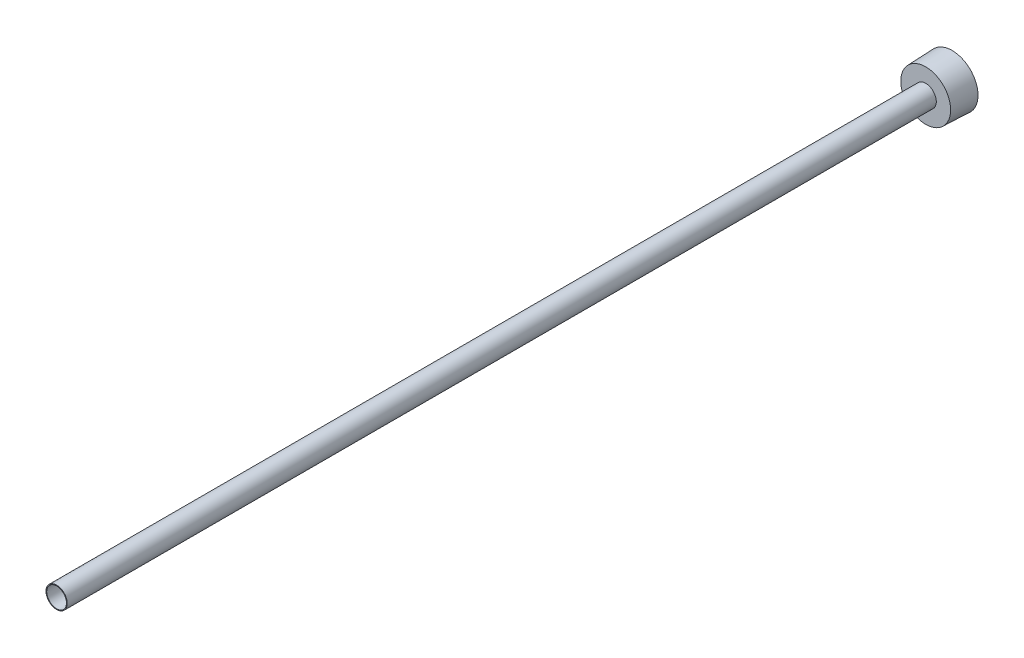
from build123d import *

# Parameters (mm, degrees)
SKETCH2_R          = 5.0419
CUT_EXTRUDE1_DEPTH = 458.582138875
CUT_EXTRUDE2_DEPTH = 9.525


with BuildPart() as part:
    # Sketch1 → Revolve1 (revolve)
    with BuildSketch(Plane(origin=(0, 0, 0), x_dir=(0, 0, -1), z_dir=(1, 0, 0)), mode=Mode.PRIVATE) as revolve1_sk:
        Polygon((-457.2, 0), (0, 0), (0, 13.2207), (-13.4874, 12.728732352), (-13.4874, 5.4229), (-457.2, 5.4229), align=None)
    revolve(revolve1_sk.sketch.rotate(Axis((0, 0, 278.001114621), (0, 0, -1)), 90), axis=Axis((0, 0, 278.001114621), (0, 0, -1)))

    # Sketch2 → Cut-Extrude1 (cut, through all)
    with BuildSketch(Plane.XY.offset(457.2)):
        Circle(SKETCH2_R)
    extrude(amount=-CUT_EXTRUDE1_DEPTH, mode=Mode.SUBTRACT)

    # Sketch3 → Cut-Extrude2 (cut)
    with BuildSketch(Plane(origin=(0, 0, 0), x_dir=(-1, 0, 0), z_dir=(0, 0, -1))):
        Polygon((-9.525, -5.499261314), (0, -10.998522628), (9.525, -5.499261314), (9.525, 5.499261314), (0, 10.998522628), (-9.525, 5.499261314), align=None)
    extrude(amount=-CUT_EXTRUDE2_DEPTH, mode=Mode.SUBTRACT)


solid = part.part
